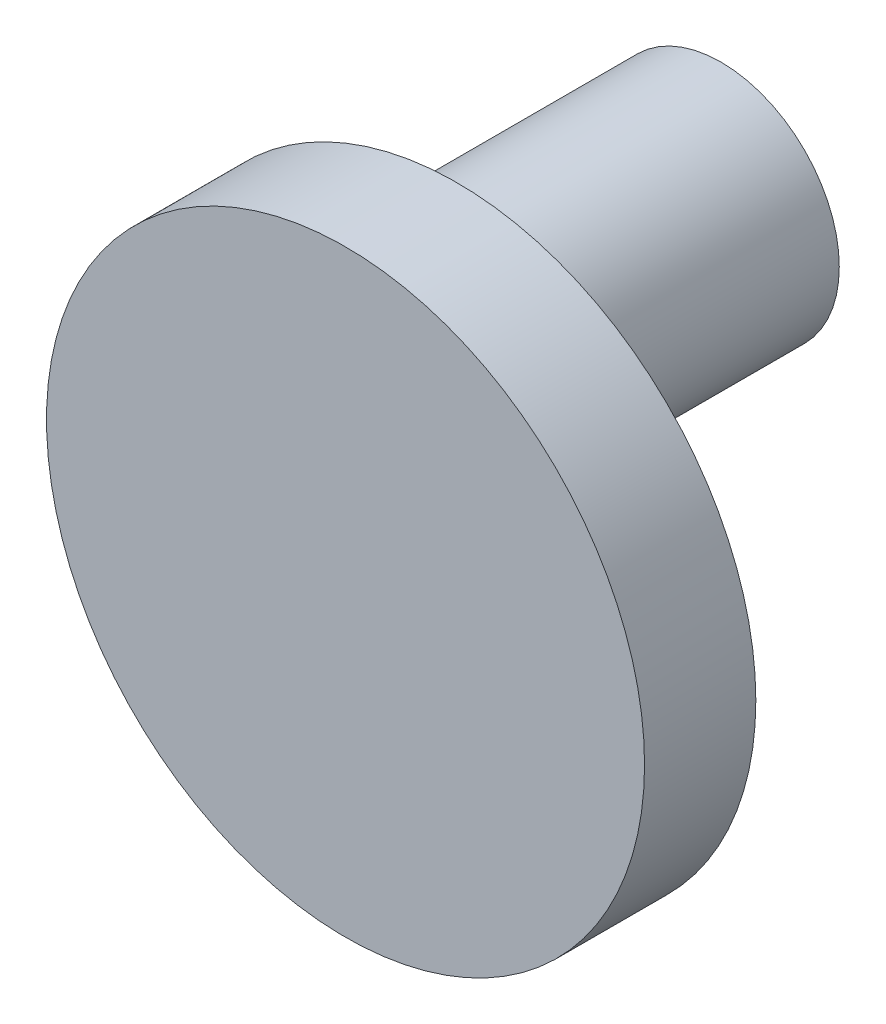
ISO-10303-21;
HEADER;
FILE_DESCRIPTION(('STEP AP214'),'2;1');
FILE_NAME('part.step','',(''),(''),'','','');
FILE_SCHEMA(('AUTOMOTIVE_DESIGN { 1 0 10303 214 1 1 1 1 }'));
ENDSEC;
DATA;
#1=APPLICATION_CONTEXT('core data for automotive mechanical design processes');
#2=APPLICATION_PROTOCOL_DEFINITION('international standard','automotive_design',2000,#1);
#3=PRODUCT_CONTEXT('',#1,'mechanical');
#4=PRODUCT('Part','Part','',(#3));
#5=PRODUCT_RELATED_PRODUCT_CATEGORY('part','',(#4));
#6=PRODUCT_DEFINITION_FORMATION('','',#4);
#7=PRODUCT_DEFINITION_CONTEXT('part definition',#1,'design');
#8=PRODUCT_DEFINITION('design','',#6,#7);
#9=PRODUCT_DEFINITION_SHAPE('','',#8);
#10=(LENGTH_UNIT() NAMED_UNIT(*) SI_UNIT(.MILLI.,.METRE.));
#11=(NAMED_UNIT(*) PLANE_ANGLE_UNIT() SI_UNIT($,.RADIAN.));
#12=(NAMED_UNIT(*) SI_UNIT($,.STERADIAN.) SOLID_ANGLE_UNIT());
#13=UNCERTAINTY_MEASURE_WITH_UNIT(LENGTH_MEASURE(1.E-05),#10,'distance_accuracy_value','');
#14=(GEOMETRIC_REPRESENTATION_CONTEXT(3) GLOBAL_UNCERTAINTY_ASSIGNED_CONTEXT((#13)) GLOBAL_UNIT_ASSIGNED_CONTEXT((#10,
#11,#12)) REPRESENTATION_CONTEXT('',''));
#15=CARTESIAN_POINT('',(0.,0.,0.));
#16=DIRECTION('',(0.,0.,1.));
#17=DIRECTION('',(1.,0.,0.));
#18=AXIS2_PLACEMENT_3D('',#15,#16,#17);
#19=CARTESIAN_POINT('',(0.,0.,-8.));
#20=DIRECTION('',(0.,0.,1.));
#21=DIRECTION('',(1.,0.,0.));
#22=AXIS2_PLACEMENT_3D('',#19,#20,#21);
#23=PLANE('',#22);
#24=CARTESIAN_POINT('',(0.,0.,-8.));
#25=DIRECTION('',(0.,0.,1.));
#26=DIRECTION('',(1.,0.,0.));
#27=AXIS2_PLACEMENT_3D('',#24,#25,#26);
#28=CIRCLE('',#27,21.5);
#29=CARTESIAN_POINT('',(21.5,0.,-8.));
#30=VERTEX_POINT('',#29);
#31=EDGE_CURVE('E360',#30,#30,#28,.T.);
#32=ORIENTED_EDGE('',*,*,#31,.F.);
#33=EDGE_LOOP('',(#32));
#34=FACE_BOUND('',#33,.T.);
#35=CARTESIAN_POINT('',(-11.,0.,-8.));
#36=DIRECTION('',(0.,0.,1.));
#37=DIRECTION('',(1.,0.,0.));
#38=AXIS2_PLACEMENT_3D('',#35,#36,#37);
#39=CIRCLE('',#38,8.5);
#40=CARTESIAN_POINT('',(-2.50000000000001,0.,-8.));
#41=VERTEX_POINT('',#40);
#42=EDGE_CURVE('E10',#41,#41,#39,.F.);
#43=ORIENTED_EDGE('',*,*,#42,.F.);
#44=EDGE_LOOP('',(#43));
#45=FACE_BOUND('',#44,.T.);
#46=ADVANCED_FACE('F353',(#34,#45),#23,.F.);
#47=CARTESIAN_POINT('',(0.,0.,-8.));
#48=DIRECTION('',(0.,0.,1.));
#49=DIRECTION('',(1.,0.,0.));
#50=AXIS2_PLACEMENT_3D('',#47,#48,#49);
#51=CYLINDRICAL_SURFACE('',#50,21.5);
#52=ORIENTED_EDGE('',*,*,#31,.T.);
#53=EDGE_LOOP('',(#52));
#54=FACE_BOUND('',#53,.T.);
#55=CARTESIAN_POINT('',(0.,0.,0.));
#56=DIRECTION('',(0.,0.,1.));
#57=DIRECTION('',(1.,0.,0.));
#58=AXIS2_PLACEMENT_3D('',#55,#56,#57);
#59=CIRCLE('',#58,21.5);
#60=CARTESIAN_POINT('',(21.5,0.,0.));
#61=VERTEX_POINT('',#60);
#62=EDGE_CURVE('E364',#61,#61,#59,.T.);
#63=ORIENTED_EDGE('',*,*,#62,.F.);
#64=EDGE_LOOP('',(#63));
#65=FACE_BOUND('',#64,.T.);
#66=ADVANCED_FACE('F355',(#54,#65),#51,.T.);
#67=CARTESIAN_POINT('',(0.,0.,0.));
#68=DIRECTION('',(0.,0.,1.));
#69=DIRECTION('',(1.,0.,0.));
#70=AXIS2_PLACEMENT_3D('',#67,#68,#69);
#71=PLANE('',#70);
#72=ORIENTED_EDGE('',*,*,#62,.T.);
#73=EDGE_LOOP('',(#72));
#74=FACE_BOUND('',#73,.T.);
#75=ADVANCED_FACE('F378',(#74),#71,.T.);
#76=CARTESIAN_POINT('',(-11.,0.,-38.));
#77=DIRECTION('',(0.,0.,1.));
#78=DIRECTION('',(1.,0.,0.));
#79=AXIS2_PLACEMENT_3D('',#76,#77,#78);
#80=CYLINDRICAL_SURFACE('',#79,8.5);
#81=CARTESIAN_POINT('',(-11.,0.,-38.));
#82=DIRECTION('',(0.,0.,-1.));
#83=DIRECTION('',(-1.,0.,0.));
#84=AXIS2_PLACEMENT_3D('',#81,#82,#83);
#85=CIRCLE('',#84,8.5);
#86=CARTESIAN_POINT('',(-19.5,0.,-38.));
#87=VERTEX_POINT('',#86);
#88=EDGE_CURVE('E368',#87,#87,#85,.T.);
#89=ORIENTED_EDGE('',*,*,#88,.F.);
#90=EDGE_LOOP('',(#89));
#91=FACE_BOUND('',#90,.T.);
#92=ORIENTED_EDGE('',*,*,#42,.T.);
#93=EDGE_LOOP('',(#92));
#94=FACE_BOUND('',#93,.T.);
#95=ADVANCED_FACE('F376',(#91,#94),#80,.T.);
#96=CARTESIAN_POINT('',(-11.,0.,-38.));
#97=DIRECTION('',(0.,0.,-1.));
#98=DIRECTION('',(-1.,0.,0.));
#99=AXIS2_PLACEMENT_3D('',#96,#97,#98);
#100=PLANE('',#99);
#101=ORIENTED_EDGE('',*,*,#88,.T.);
#102=EDGE_LOOP('',(#101));
#103=FACE_BOUND('',#102,.T.);
#104=ADVANCED_FACE('F374',(#103),#100,.T.);
#105=CLOSED_SHELL('',(#46,#66,#75,#95,#104));
#106=MANIFOLD_SOLID_BREP('B2',#105);
#107=ADVANCED_BREP_SHAPE_REPRESENTATION('',(#18,#106),#14);
#108=SHAPE_DEFINITION_REPRESENTATION(#9,#107);
ENDSEC;
END-ISO-10303-21;
